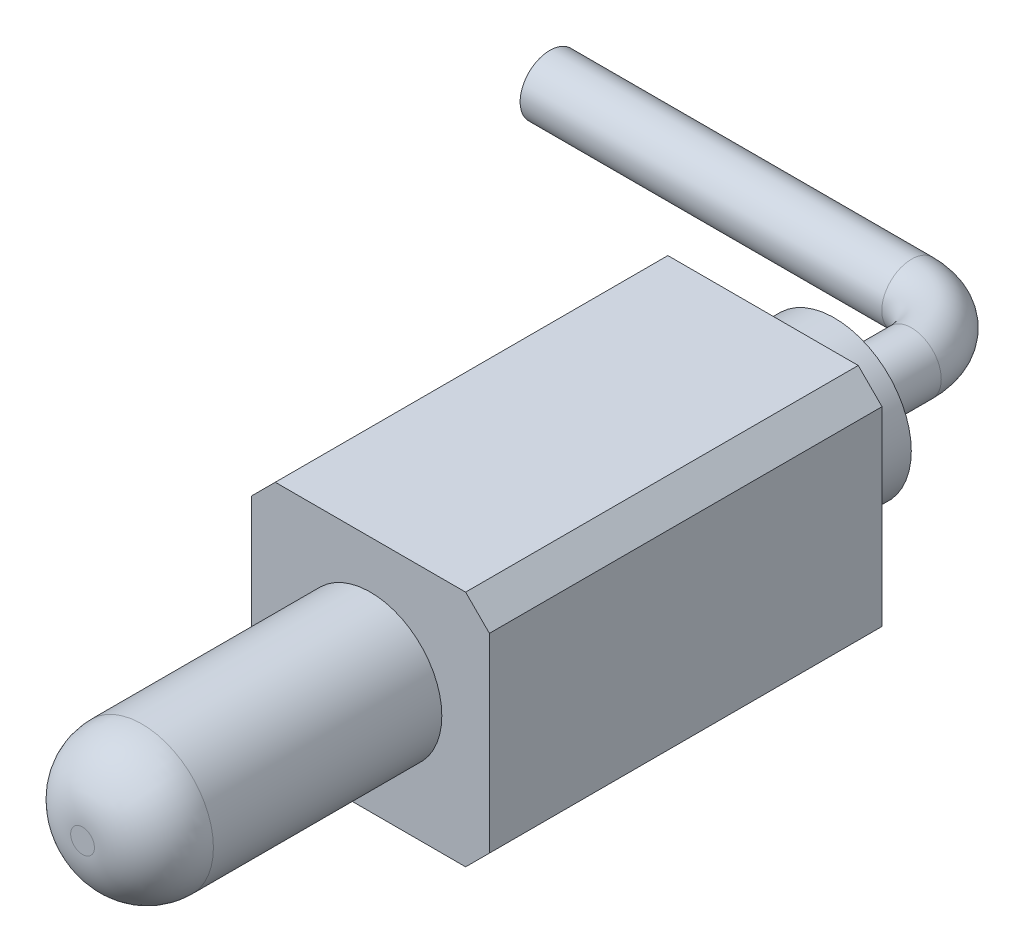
ISO-10303-21;
HEADER;
FILE_DESCRIPTION(('STEP AP214'),'2;1');
FILE_NAME('part.step','',(''),(''),'','','');
FILE_SCHEMA(('AUTOMOTIVE_DESIGN { 1 0 10303 214 1 1 1 1 }'));
ENDSEC;
DATA;
#1=APPLICATION_CONTEXT('core data for automotive mechanical design processes');
#2=APPLICATION_PROTOCOL_DEFINITION('international standard','automotive_design',2000,#1);
#3=PRODUCT_CONTEXT('',#1,'mechanical');
#4=PRODUCT('Part','Part','',(#3));
#5=PRODUCT_RELATED_PRODUCT_CATEGORY('part','',(#4));
#6=PRODUCT_DEFINITION_FORMATION('','',#4);
#7=PRODUCT_DEFINITION_CONTEXT('part definition',#1,'design');
#8=PRODUCT_DEFINITION('design','',#6,#7);
#9=PRODUCT_DEFINITION_SHAPE('','',#8);
#10=(LENGTH_UNIT() NAMED_UNIT(*) SI_UNIT(.MILLI.,.METRE.));
#11=(NAMED_UNIT(*) PLANE_ANGLE_UNIT() SI_UNIT($,.RADIAN.));
#12=(NAMED_UNIT(*) SI_UNIT($,.STERADIAN.) SOLID_ANGLE_UNIT());
#13=UNCERTAINTY_MEASURE_WITH_UNIT(LENGTH_MEASURE(1.E-05),#10,'distance_accuracy_value','');
#14=(GEOMETRIC_REPRESENTATION_CONTEXT(3) GLOBAL_UNCERTAINTY_ASSIGNED_CONTEXT((#13)) GLOBAL_UNIT_ASSIGNED_CONTEXT((#10,
#11,#12)) REPRESENTATION_CONTEXT('',''));
#15=CARTESIAN_POINT('',(0.,0.,0.));
#16=DIRECTION('',(0.,0.,1.));
#17=DIRECTION('',(1.,0.,0.));
#18=AXIS2_PLACEMENT_3D('',#15,#16,#17);
#19=CARTESIAN_POINT('',(-3.2258,1.27,-2.22006840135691));
#20=DIRECTION('',(1.,0.,0.));
#21=DIRECTION('',(0.,0.,-1.));
#22=AXIS2_PLACEMENT_3D('',#19,#20,#21);
#23=CYLINDRICAL_SURFACE('',#22,0.3175);
#24=CARTESIAN_POINT('',(-3.2258,1.27,-2.22006840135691));
#25=DIRECTION('',(-1.,0.,0.));
#26=DIRECTION('',(0.,0.,1.));
#27=AXIS2_PLACEMENT_3D('',#24,#25,#26);
#28=CIRCLE('',#27,0.3175);
#29=CARTESIAN_POINT('',(-3.2258,1.27,-1.90256840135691));
#30=VERTEX_POINT('',#29);
#31=EDGE_CURVE('E11',#30,#30,#28,.T.);
#32=ORIENTED_EDGE('',*,*,#31,.F.);
#33=EDGE_LOOP('',(#32));
#34=FACE_BOUND('',#33,.T.);
#35=CARTESIAN_POINT('',(0.635,1.27,-2.22006840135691));
#36=DIRECTION('',(1.,0.,0.));
#37=DIRECTION('',(0.,0.,-1.));
#38=AXIS2_PLACEMENT_3D('',#35,#36,#37);
#39=CIRCLE('',#38,0.3175);
#40=CARTESIAN_POINT('',(0.635,1.27,-2.53756840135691));
#41=VERTEX_POINT('',#40);
#42=EDGE_CURVE('E170',#41,#41,#39,.T.);
#43=ORIENTED_EDGE('',*,*,#42,.F.);
#44=EDGE_LOOP('',(#43));
#45=FACE_BOUND('',#44,.T.);
#46=ADVANCED_FACE('F33',(#34,#45),#23,.T.);
#47=CARTESIAN_POINT('',(-3.2258,1.27,-2.22006840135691));
#48=DIRECTION('',(-1.,0.,0.));
#49=DIRECTION('',(0.,0.,1.));
#50=AXIS2_PLACEMENT_3D('',#47,#48,#49);
#51=PLANE('',#50);
#52=ORIENTED_EDGE('',*,*,#31,.T.);
#53=EDGE_LOOP('',(#52));
#54=FACE_BOUND('',#53,.T.);
#55=ADVANCED_FACE('F184',(#54),#51,.T.);
#56=CARTESIAN_POINT('',(1.27,1.27,-1.58506840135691));
#57=DIRECTION('',(0.,0.,1.));
#58=DIRECTION('',(1.,0.,0.));
#59=AXIS2_PLACEMENT_3D('',#56,#57,#58);
#60=CYLINDRICAL_SURFACE('',#59,0.3175);
#61=CARTESIAN_POINT('',(1.27,1.27,-1.58506840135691));
#62=DIRECTION('',(0.,0.,1.));
#63=DIRECTION('',(1.,0.,0.));
#64=AXIS2_PLACEMENT_3D('',#61,#62,#63);
#65=CIRCLE('',#64,0.3175);
#66=CARTESIAN_POINT('',(1.5875,1.27,-1.58506840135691));
#67=VERTEX_POINT('',#66);
#68=EDGE_CURVE('E173',#67,#67,#65,.T.);
#69=ORIENTED_EDGE('',*,*,#68,.T.);
#70=EDGE_LOOP('',(#69));
#71=FACE_BOUND('',#70,.T.);
#72=CARTESIAN_POINT('',(1.27,1.27,-0.762));
#73=DIRECTION('',(0.,0.,1.));
#74=DIRECTION('',(1.,0.,0.));
#75=AXIS2_PLACEMENT_3D('',#72,#73,#74);
#76=CIRCLE('',#75,0.3175);
#77=CARTESIAN_POINT('',(1.5875,1.27,-0.762));
#78=VERTEX_POINT('',#77);
#79=EDGE_CURVE('E41',#78,#78,#76,.T.);
#80=ORIENTED_EDGE('',*,*,#79,.F.);
#81=EDGE_LOOP('',(#80));
#82=FACE_BOUND('',#81,.T.);
#83=ADVANCED_FACE('F181',(#71,#82),#60,.T.);
#84=CARTESIAN_POINT('',(0.635,1.27,-1.58506840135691));
#85=DIRECTION('',(0.,-1.,0.));
#86=DIRECTION('',(0.,0.,-1.));
#87=AXIS2_PLACEMENT_3D('',#84,#85,#86);
#88=TOROIDAL_SURFACE('',#87,0.635,0.3175);
#89=CARTESIAN_POINT('',(0.635,1.27,-1.58506840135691));
#90=DIRECTION('',(0.,-1.,0.));
#91=DIRECTION('',(0.,0.,-1.));
#92=AXIS2_PLACEMENT_3D('',#89,#90,#91);
#93=CIRCLE('',#92,0.9525);
#94=EDGE_CURVE('',#41,#67,#93,.T.);
#95=ORIENTED_EDGE('',*,*,#42,.T.);
#96=ORIENTED_EDGE('',*,*,#68,.F.);
#97=ORIENTED_EDGE('',*,*,#94,.T.);
#98=ORIENTED_EDGE('',*,*,#94,.F.);
#99=EDGE_LOOP('',(#95,#97,#96,#98));
#100=FACE_BOUND('',#99,.T.);
#101=ADVANCED_FACE('F183',(#100),#88,.T.);
#102=CARTESIAN_POINT('',(0.,0.,0.));
#103=DIRECTION('',(0.,0.,1.));
#104=DIRECTION('',(1.,0.,0.));
#105=AXIS2_PLACEMENT_3D('',#102,#103,#104);
#106=PLANE('',#105);
#107=DIRECTION('',(-1.,0.,0.));
#108=VECTOR('',#107,1.);
#109=CARTESIAN_POINT('',(0.254,2.54,0.));
#110=LINE('',#109,#108);
#111=CARTESIAN_POINT('',(2.286,2.54,0.));
#112=VERTEX_POINT('',#111);
#113=CARTESIAN_POINT('',(0.254,2.54,0.));
#114=VERTEX_POINT('',#113);
#115=EDGE_CURVE('E131',#112,#114,#110,.T.);
#116=ORIENTED_EDGE('',*,*,#115,.F.);
#117=DIRECTION('',(-0.707106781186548,0.707106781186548,0.));
#118=VECTOR('',#117,1.);
#119=CARTESIAN_POINT('',(2.286,2.54,0.));
#120=LINE('',#119,#118);
#121=CARTESIAN_POINT('',(2.54,2.286,0.));
#122=VERTEX_POINT('',#121);
#123=EDGE_CURVE('E84',#122,#112,#120,.T.);
#124=ORIENTED_EDGE('',*,*,#123,.F.);
#125=DIRECTION('',(0.,1.,0.));
#126=VECTOR('',#125,1.);
#127=CARTESIAN_POINT('',(2.54,0.254,0.));
#128=LINE('',#127,#126);
#129=CARTESIAN_POINT('',(2.54,0.254,0.));
#130=VERTEX_POINT('',#129);
#131=EDGE_CURVE('E78',#130,#122,#128,.T.);
#132=ORIENTED_EDGE('',*,*,#131,.F.);
#133=DIRECTION('',(0.707106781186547,0.707106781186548,0.));
#134=VECTOR('',#133,1.);
#135=CARTESIAN_POINT('',(2.286,0.,0.));
#136=LINE('',#135,#134);
#137=CARTESIAN_POINT('',(2.286,0.,0.));
#138=VERTEX_POINT('',#137);
#139=EDGE_CURVE('E121',#138,#130,#136,.T.);
#140=ORIENTED_EDGE('',*,*,#139,.F.);
#141=DIRECTION('',(1.,0.,0.));
#142=VECTOR('',#141,1.);
#143=CARTESIAN_POINT('',(0.254,0.,0.));
#144=LINE('',#143,#142);
#145=CARTESIAN_POINT('',(0.254,0.,0.));
#146=VERTEX_POINT('',#145);
#147=EDGE_CURVE('E141',#146,#138,#144,.T.);
#148=ORIENTED_EDGE('',*,*,#147,.F.);
#149=DIRECTION('',(0.707106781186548,-0.707106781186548,0.));
#150=VECTOR('',#149,1.);
#151=CARTESIAN_POINT('',(0.,0.254,0.));
#152=LINE('',#151,#150);
#153=CARTESIAN_POINT('',(0.,0.254,0.));
#154=VERTEX_POINT('',#153);
#155=EDGE_CURVE('E139',#154,#146,#152,.T.);
#156=ORIENTED_EDGE('',*,*,#155,.F.);
#157=DIRECTION('',(0.,-1.,0.));
#158=VECTOR('',#157,1.);
#159=CARTESIAN_POINT('',(0.,0.254,0.));
#160=LINE('',#159,#158);
#161=CARTESIAN_POINT('',(0.,2.286,0.));
#162=VERTEX_POINT('',#161);
#163=EDGE_CURVE('E137',#162,#154,#160,.T.);
#164=ORIENTED_EDGE('',*,*,#163,.F.);
#165=DIRECTION('',(-0.707106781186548,-0.707106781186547,0.));
#166=VECTOR('',#165,1.);
#167=CARTESIAN_POINT('',(0.,2.286,0.));
#168=LINE('',#167,#166);
#169=EDGE_CURVE('E134',#114,#162,#168,.T.);
#170=ORIENTED_EDGE('',*,*,#169,.F.);
#171=EDGE_LOOP('',(#116,#124,#132,#140,#148,#156,#164,#170));
#172=FACE_BOUND('',#171,.T.);
#173=CARTESIAN_POINT('',(1.27,1.27,0.));
#174=DIRECTION('',(0.,0.,1.));
#175=DIRECTION('',(1.,0.,0.));
#176=AXIS2_PLACEMENT_3D('',#173,#174,#175);
#177=CIRCLE('',#176,0.820584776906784);
#178=CARTESIAN_POINT('',(2.09058477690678,1.27,0.));
#179=VERTEX_POINT('',#178);
#180=EDGE_CURVE('E167',#179,#179,#177,.F.);
#181=ORIENTED_EDGE('',*,*,#180,.F.);
#182=EDGE_LOOP('',(#181));
#183=FACE_BOUND('',#182,.T.);
#184=ADVANCED_FACE('F191',(#172,#183),#106,.F.);
#185=CARTESIAN_POINT('',(0.,0.,4.191));
#186=DIRECTION('',(0.,0.,1.));
#187=DIRECTION('',(1.,0.,0.));
#188=AXIS2_PLACEMENT_3D('',#185,#186,#187);
#189=PLANE('',#188);
#190=DIRECTION('',(-1.,0.,0.));
#191=VECTOR('',#190,1.);
#192=CARTESIAN_POINT('',(0.254,2.54,4.191));
#193=LINE('',#192,#191);
#194=CARTESIAN_POINT('',(2.286,2.54,4.191));
#195=VERTEX_POINT('',#194);
#196=CARTESIAN_POINT('',(0.254,2.54,4.191));
#197=VERTEX_POINT('',#196);
#198=EDGE_CURVE('E146',#195,#197,#193,.T.);
#199=ORIENTED_EDGE('',*,*,#198,.T.);
#200=DIRECTION('',(-0.707106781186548,-0.707106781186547,0.));
#201=VECTOR('',#200,1.);
#202=CARTESIAN_POINT('',(0.,2.286,4.191));
#203=LINE('',#202,#201);
#204=CARTESIAN_POINT('',(0.,2.286,4.191));
#205=VERTEX_POINT('',#204);
#206=EDGE_CURVE('E93',#197,#205,#203,.T.);
#207=ORIENTED_EDGE('',*,*,#206,.T.);
#208=DIRECTION('',(0.,-1.,0.));
#209=VECTOR('',#208,1.);
#210=CARTESIAN_POINT('',(0.,0.254,4.191));
#211=LINE('',#210,#209);
#212=CARTESIAN_POINT('',(0.,0.254,4.191));
#213=VERTEX_POINT('',#212);
#214=EDGE_CURVE('E378',#205,#213,#211,.T.);
#215=ORIENTED_EDGE('',*,*,#214,.T.);
#216=DIRECTION('',(0.707106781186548,-0.707106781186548,0.));
#217=VECTOR('',#216,1.);
#218=CARTESIAN_POINT('',(0.,0.254,4.191));
#219=LINE('',#218,#217);
#220=CARTESIAN_POINT('',(0.254,0.,4.191));
#221=VERTEX_POINT('',#220);
#222=EDGE_CURVE('E380',#213,#221,#219,.T.);
#223=ORIENTED_EDGE('',*,*,#222,.T.);
#224=DIRECTION('',(1.,0.,0.));
#225=VECTOR('',#224,1.);
#226=CARTESIAN_POINT('',(0.254,0.,4.191));
#227=LINE('',#226,#225);
#228=CARTESIAN_POINT('',(2.286,0.,4.191));
#229=VERTEX_POINT('',#228);
#230=EDGE_CURVE('E113',#221,#229,#227,.T.);
#231=ORIENTED_EDGE('',*,*,#230,.T.);
#232=DIRECTION('',(0.707106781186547,0.707106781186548,0.));
#233=VECTOR('',#232,1.);
#234=CARTESIAN_POINT('',(2.286,0.,4.191));
#235=LINE('',#234,#233);
#236=CARTESIAN_POINT('',(2.54,0.254,4.191));
#237=VERTEX_POINT('',#236);
#238=EDGE_CURVE('E106',#229,#237,#235,.T.);
#239=ORIENTED_EDGE('',*,*,#238,.T.);
#240=DIRECTION('',(0.,1.,0.));
#241=VECTOR('',#240,1.);
#242=CARTESIAN_POINT('',(2.54,0.254,4.191));
#243=LINE('',#242,#241);
#244=CARTESIAN_POINT('',(2.54,2.286,4.191));
#245=VERTEX_POINT('',#244);
#246=EDGE_CURVE('E111',#237,#245,#243,.T.);
#247=ORIENTED_EDGE('',*,*,#246,.T.);
#248=DIRECTION('',(-0.707106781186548,0.707106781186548,0.));
#249=VECTOR('',#248,1.);
#250=CARTESIAN_POINT('',(2.286,2.54,4.191));
#251=LINE('',#250,#249);
#252=EDGE_CURVE('E49',#245,#195,#251,.T.);
#253=ORIENTED_EDGE('',*,*,#252,.T.);
#254=EDGE_LOOP('',(#199,#207,#215,#223,#231,#239,#247,#253));
#255=FACE_BOUND('',#254,.T.);
#256=CARTESIAN_POINT('',(1.27,1.27,4.191));
#257=DIRECTION('',(0.,0.,1.));
#258=DIRECTION('',(1.,0.,0.));
#259=AXIS2_PLACEMENT_3D('',#256,#257,#258);
#260=CIRCLE('',#259,0.762);
#261=CARTESIAN_POINT('',(2.032,1.27,4.191));
#262=VERTEX_POINT('',#261);
#263=EDGE_CURVE('E135',#262,#262,#260,.T.);
#264=ORIENTED_EDGE('',*,*,#263,.F.);
#265=EDGE_LOOP('',(#264));
#266=FACE_BOUND('',#265,.T.);
#267=ADVANCED_FACE('F108',(#255,#266),#189,.T.);
#268=CARTESIAN_POINT('',(0.254,2.54,4.191));
#269=DIRECTION('',(0.,-1.,0.));
#270=DIRECTION('',(0.,0.,-1.));
#271=AXIS2_PLACEMENT_3D('',#268,#269,#270);
#272=PLANE('',#271);
#273=ORIENTED_EDGE('',*,*,#115,.T.);
#274=DIRECTION('',(0.,0.,-1.));
#275=VECTOR('',#274,1.);
#276=CARTESIAN_POINT('',(0.254,2.54,4.191));
#277=LINE('',#276,#275);
#278=EDGE_CURVE('E159',#197,#114,#277,.T.);
#279=ORIENTED_EDGE('',*,*,#278,.F.);
#280=ORIENTED_EDGE('',*,*,#198,.F.);
#281=DIRECTION('',(0.,0.,-1.));
#282=VECTOR('',#281,1.);
#283=CARTESIAN_POINT('',(2.286,2.54,4.191));
#284=LINE('',#283,#282);
#285=EDGE_CURVE('E127',#195,#112,#284,.T.);
#286=ORIENTED_EDGE('',*,*,#285,.T.);
#287=EDGE_LOOP('',(#273,#279,#280,#286));
#288=FACE_BOUND('',#287,.T.);
#289=ADVANCED_FACE('F230',(#288),#272,.F.);
#290=CARTESIAN_POINT('',(0.,2.286,4.191));
#291=DIRECTION('',(0.707106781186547,-0.707106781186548,0.));
#292=DIRECTION('',(0.707106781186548,0.707106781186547,0.));
#293=AXIS2_PLACEMENT_3D('',#290,#291,#292);
#294=PLANE('',#293);
#295=ORIENTED_EDGE('',*,*,#169,.T.);
#296=DIRECTION('',(0.,0.,-1.));
#297=VECTOR('',#296,1.);
#298=CARTESIAN_POINT('',(0.,2.286,4.191));
#299=LINE('',#298,#297);
#300=EDGE_CURVE('E156',#205,#162,#299,.T.);
#301=ORIENTED_EDGE('',*,*,#300,.F.);
#302=ORIENTED_EDGE('',*,*,#206,.F.);
#303=ORIENTED_EDGE('',*,*,#278,.T.);
#304=EDGE_LOOP('',(#295,#301,#302,#303));
#305=FACE_BOUND('',#304,.T.);
#306=ADVANCED_FACE('F238',(#305),#294,.F.);
#307=CARTESIAN_POINT('',(0.,0.254,4.191));
#308=DIRECTION('',(1.,0.,0.));
#309=DIRECTION('',(0.,0.,-1.));
#310=AXIS2_PLACEMENT_3D('',#307,#308,#309);
#311=PLANE('',#310);
#312=ORIENTED_EDGE('',*,*,#163,.T.);
#313=DIRECTION('',(0.,0.,-1.));
#314=VECTOR('',#313,1.);
#315=CARTESIAN_POINT('',(0.,0.254,4.191));
#316=LINE('',#315,#314);
#317=EDGE_CURVE('E153',#213,#154,#316,.T.);
#318=ORIENTED_EDGE('',*,*,#317,.F.);
#319=ORIENTED_EDGE('',*,*,#214,.F.);
#320=ORIENTED_EDGE('',*,*,#300,.T.);
#321=EDGE_LOOP('',(#312,#318,#319,#320));
#322=FACE_BOUND('',#321,.T.);
#323=ADVANCED_FACE('F247',(#322),#311,.F.);
#324=CARTESIAN_POINT('',(0.,0.254,4.191));
#325=DIRECTION('',(0.707106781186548,0.707106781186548,0.));
#326=DIRECTION('',(-0.707106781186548,0.707106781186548,0.));
#327=AXIS2_PLACEMENT_3D('',#324,#325,#326);
#328=PLANE('',#327);
#329=ORIENTED_EDGE('',*,*,#155,.T.);
#330=DIRECTION('',(0.,0.,-1.));
#331=VECTOR('',#330,1.);
#332=CARTESIAN_POINT('',(0.254,0.,4.191));
#333=LINE('',#332,#331);
#334=EDGE_CURVE('E150',#221,#146,#333,.T.);
#335=ORIENTED_EDGE('',*,*,#334,.F.);
#336=ORIENTED_EDGE('',*,*,#222,.F.);
#337=ORIENTED_EDGE('',*,*,#317,.T.);
#338=EDGE_LOOP('',(#329,#335,#336,#337));
#339=FACE_BOUND('',#338,.T.);
#340=ADVANCED_FACE('F255',(#339),#328,.F.);
#341=CARTESIAN_POINT('',(0.254,0.,4.191));
#342=DIRECTION('',(0.,1.,0.));
#343=DIRECTION('',(0.,0.,1.));
#344=AXIS2_PLACEMENT_3D('',#341,#342,#343);
#345=PLANE('',#344);
#346=ORIENTED_EDGE('',*,*,#147,.T.);
#347=DIRECTION('',(0.,0.,-1.));
#348=VECTOR('',#347,1.);
#349=CARTESIAN_POINT('',(2.286,0.,4.191));
#350=LINE('',#349,#348);
#351=EDGE_CURVE('E122',#229,#138,#350,.T.);
#352=ORIENTED_EDGE('',*,*,#351,.F.);
#353=ORIENTED_EDGE('',*,*,#230,.F.);
#354=ORIENTED_EDGE('',*,*,#334,.T.);
#355=EDGE_LOOP('',(#346,#352,#353,#354));
#356=FACE_BOUND('',#355,.T.);
#357=ADVANCED_FACE('F264',(#356),#345,.F.);
#358=CARTESIAN_POINT('',(2.286,0.,4.191));
#359=DIRECTION('',(-0.707106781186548,0.707106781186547,0.));
#360=DIRECTION('',(-0.707106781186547,-0.707106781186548,0.));
#361=AXIS2_PLACEMENT_3D('',#358,#359,#360);
#362=PLANE('',#361);
#363=ORIENTED_EDGE('',*,*,#139,.T.);
#364=DIRECTION('',(0.,0.,-1.));
#365=VECTOR('',#364,1.);
#366=CARTESIAN_POINT('',(2.54,0.254,4.191));
#367=LINE('',#366,#365);
#368=EDGE_CURVE('E118',#237,#130,#367,.T.);
#369=ORIENTED_EDGE('',*,*,#368,.F.);
#370=ORIENTED_EDGE('',*,*,#238,.F.);
#371=ORIENTED_EDGE('',*,*,#351,.T.);
#372=EDGE_LOOP('',(#363,#369,#370,#371));
#373=FACE_BOUND('',#372,.T.);
#374=ADVANCED_FACE('F119',(#373),#362,.F.);
#375=CARTESIAN_POINT('',(2.54,0.254,4.191));
#376=DIRECTION('',(-1.,0.,0.));
#377=DIRECTION('',(0.,0.,1.));
#378=AXIS2_PLACEMENT_3D('',#375,#376,#377);
#379=PLANE('',#378);
#380=ORIENTED_EDGE('',*,*,#131,.T.);
#381=DIRECTION('',(0.,0.,-1.));
#382=VECTOR('',#381,1.);
#383=CARTESIAN_POINT('',(2.54,2.286,4.191));
#384=LINE('',#383,#382);
#385=EDGE_CURVE('E123',#245,#122,#384,.T.);
#386=ORIENTED_EDGE('',*,*,#385,.F.);
#387=ORIENTED_EDGE('',*,*,#246,.F.);
#388=ORIENTED_EDGE('',*,*,#368,.T.);
#389=EDGE_LOOP('',(#380,#386,#387,#388));
#390=FACE_BOUND('',#389,.T.);
#391=ADVANCED_FACE('F125',(#390),#379,.F.);
#392=CARTESIAN_POINT('',(2.286,2.54,4.191));
#393=DIRECTION('',(-0.707106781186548,-0.707106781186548,0.));
#394=DIRECTION('',(0.707106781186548,-0.707106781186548,0.));
#395=AXIS2_PLACEMENT_3D('',#392,#393,#394);
#396=PLANE('',#395);
#397=ORIENTED_EDGE('',*,*,#123,.T.);
#398=ORIENTED_EDGE('',*,*,#285,.F.);
#399=ORIENTED_EDGE('',*,*,#252,.F.);
#400=ORIENTED_EDGE('',*,*,#385,.T.);
#401=EDGE_LOOP('',(#397,#398,#399,#400));
#402=FACE_BOUND('',#401,.T.);
#403=ADVANCED_FACE('F288',(#402),#396,.F.);
#404=CARTESIAN_POINT('',(1.27,1.27,7.2644));
#405=DIRECTION('',(0.,0.,-1.));
#406=DIRECTION('',(-1.,0.,0.));
#407=AXIS2_PLACEMENT_3D('',#404,#405,#406);
#408=CYLINDRICAL_SURFACE('',#407,0.762);
#409=CARTESIAN_POINT('',(1.27,1.27,6.6294));
#410=DIRECTION('',(0.,0.,1.));
#411=DIRECTION('',(1.,0.,0.));
#412=AXIS2_PLACEMENT_3D('',#409,#410,#411);
#413=CIRCLE('',#412,0.762);
#414=CARTESIAN_POINT('',(2.032,1.27,6.6294));
#415=VERTEX_POINT('',#414);
#416=EDGE_CURVE('E164',#415,#415,#413,.F.);
#417=ORIENTED_EDGE('',*,*,#416,.T.);
#418=EDGE_LOOP('',(#417));
#419=FACE_BOUND('',#418,.T.);
#420=ORIENTED_EDGE('',*,*,#263,.T.);
#421=EDGE_LOOP('',(#420));
#422=FACE_BOUND('',#421,.T.);
#423=ADVANCED_FACE('F296',(#419,#422),#408,.T.);
#424=CARTESIAN_POINT('',(1.27,1.27,7.2644));
#425=DIRECTION('',(0.,0.,1.));
#426=DIRECTION('',(1.,0.,0.));
#427=AXIS2_PLACEMENT_3D('',#424,#425,#426);
#428=PLANE('',#427);
#429=CARTESIAN_POINT('',(1.27,1.27,7.2644));
#430=DIRECTION('',(0.,0.,1.));
#431=DIRECTION('',(1.,0.,0.));
#432=AXIS2_PLACEMENT_3D('',#429,#430,#431);
#433=CIRCLE('',#432,0.127);
#434=CARTESIAN_POINT('',(1.397,1.27,7.2644));
#435=VERTEX_POINT('',#434);
#436=EDGE_CURVE('E161',#435,#435,#433,.T.);
#437=ORIENTED_EDGE('',*,*,#436,.T.);
#438=EDGE_LOOP('',(#437));
#439=FACE_BOUND('',#438,.T.);
#440=ADVANCED_FACE('F304',(#439),#428,.T.);
#441=CARTESIAN_POINT('',(1.27,1.27,6.6294));
#442=DIRECTION('',(0.,0.,1.));
#443=DIRECTION('',(1.,0.,0.));
#444=AXIS2_PLACEMENT_3D('',#441,#442,#443);
#445=DEGENERATE_TOROIDAL_SURFACE('',#444,0.127,0.635,.T.);
#446=ORIENTED_EDGE('',*,*,#416,.F.);
#447=EDGE_LOOP('',(#446));
#448=FACE_BOUND('',#447,.T.);
#449=ORIENTED_EDGE('',*,*,#436,.F.);
#450=EDGE_LOOP('',(#449));
#451=FACE_BOUND('',#450,.T.);
#452=ADVANCED_FACE('F313',(#448,#451),#445,.T.);
#453=CARTESIAN_POINT('',(1.27,1.27,-0.762));
#454=DIRECTION('',(0.,0.,1.));
#455=DIRECTION('',(1.,0.,0.));
#456=AXIS2_PLACEMENT_3D('',#453,#454,#455);
#457=CYLINDRICAL_SURFACE('',#456,0.820584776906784);
#458=CARTESIAN_POINT('',(1.27,1.27,-0.762));
#459=DIRECTION('',(0.,0.,-1.));
#460=DIRECTION('',(-1.,0.,0.));
#461=AXIS2_PLACEMENT_3D('',#458,#459,#460);
#462=CIRCLE('',#461,0.820584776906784);
#463=CARTESIAN_POINT('',(2.09058477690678,1.27,-0.762));
#464=VERTEX_POINT('',#463);
#465=EDGE_CURVE('E369',#464,#464,#462,.T.);
#466=CARTESIAN_POINT('',(2.09058477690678,1.27,-0.762));
#467=CARTESIAN_POINT('',(2.09058477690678,1.27,-0.7540625));
#468=CARTESIAN_POINT('',(2.09058477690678,1.27,-0.746125));
#469=CARTESIAN_POINT('',(2.09058477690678,1.27,-0.73025));
#470=CARTESIAN_POINT('',(2.09058477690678,1.27,-0.7223125));
#471=CARTESIAN_POINT('',(2.09058477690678,1.27,-0.7064375));
#472=CARTESIAN_POINT('',(2.09058477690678,1.27,-0.6985));
#473=CARTESIAN_POINT('',(2.09058477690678,1.27,-0.682625));
#474=CARTESIAN_POINT('',(2.09058477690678,1.27,-0.6746875));
#475=CARTESIAN_POINT('',(2.09058477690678,1.27,-0.6588125));
#476=CARTESIAN_POINT('',(2.09058477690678,1.27,-0.650875));
#477=CARTESIAN_POINT('',(2.09058477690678,1.27,-0.635));
#478=CARTESIAN_POINT('',(2.09058477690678,1.27,-0.6270625));
#479=CARTESIAN_POINT('',(2.09058477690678,1.27,-0.6111875));
#480=CARTESIAN_POINT('',(2.09058477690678,1.27,-0.60325));
#481=CARTESIAN_POINT('',(2.09058477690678,1.27,-0.587375));
#482=CARTESIAN_POINT('',(2.09058477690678,1.27,-0.5794375));
#483=CARTESIAN_POINT('',(2.09058477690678,1.27,-0.5635625));
#484=CARTESIAN_POINT('',(2.09058477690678,1.27,-0.555625));
#485=CARTESIAN_POINT('',(2.09058477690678,1.27,-0.53975));
#486=CARTESIAN_POINT('',(2.09058477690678,1.27,-0.5318125));
#487=CARTESIAN_POINT('',(2.09058477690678,1.27,-0.5159375));
#488=CARTESIAN_POINT('',(2.09058477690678,1.27,-0.508));
#489=CARTESIAN_POINT('',(2.09058477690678,1.27,-0.492125));
#490=CARTESIAN_POINT('',(2.09058477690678,1.27,-0.4841875));
#491=CARTESIAN_POINT('',(2.09058477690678,1.27,-0.4683125));
#492=CARTESIAN_POINT('',(2.09058477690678,1.27,-0.460375));
#493=CARTESIAN_POINT('',(2.09058477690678,1.27,-0.4445));
#494=CARTESIAN_POINT('',(2.09058477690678,1.27,-0.4365625));
#495=CARTESIAN_POINT('',(2.09058477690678,1.27,-0.4206875));
#496=CARTESIAN_POINT('',(2.09058477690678,1.27,-0.41275));
#497=CARTESIAN_POINT('',(2.09058477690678,1.27,-0.396875));
#498=CARTESIAN_POINT('',(2.09058477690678,1.27,-0.3889375));
#499=CARTESIAN_POINT('',(2.09058477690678,1.27,-0.3730625));
#500=CARTESIAN_POINT('',(2.09058477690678,1.27,-0.365125));
#501=CARTESIAN_POINT('',(2.09058477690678,1.27,-0.34925));
#502=CARTESIAN_POINT('',(2.09058477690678,1.27,-0.3413125));
#503=CARTESIAN_POINT('',(2.09058477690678,1.27,-0.3254375));
#504=CARTESIAN_POINT('',(2.09058477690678,1.27,-0.3175));
#505=CARTESIAN_POINT('',(2.09058477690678,1.27,-0.301625));
#506=CARTESIAN_POINT('',(2.09058477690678,1.27,-0.2936875));
#507=CARTESIAN_POINT('',(2.09058477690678,1.27,-0.2778125));
#508=CARTESIAN_POINT('',(2.09058477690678,1.27,-0.269875));
#509=CARTESIAN_POINT('',(2.09058477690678,1.27,-0.254));
#510=CARTESIAN_POINT('',(2.09058477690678,1.27,-0.2460625));
#511=CARTESIAN_POINT('',(2.09058477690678,1.27,-0.2301875));
#512=CARTESIAN_POINT('',(2.09058477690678,1.27,-0.22225));
#513=CARTESIAN_POINT('',(2.09058477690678,1.27,-0.206375));
#514=CARTESIAN_POINT('',(2.09058477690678,1.27,-0.1984375));
#515=CARTESIAN_POINT('',(2.09058477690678,1.27,-0.1825625));
#516=CARTESIAN_POINT('',(2.09058477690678,1.27,-0.174625));
#517=CARTESIAN_POINT('',(2.09058477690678,1.27,-0.15875));
#518=CARTESIAN_POINT('',(2.09058477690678,1.27,-0.1508125));
#519=CARTESIAN_POINT('',(2.09058477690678,1.27,-0.1349375));
#520=CARTESIAN_POINT('',(2.09058477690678,1.27,-0.127));
#521=CARTESIAN_POINT('',(2.09058477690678,1.27,-0.111125));
#522=CARTESIAN_POINT('',(2.09058477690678,1.27,-0.1031875));
#523=CARTESIAN_POINT('',(2.09058477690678,1.27,-0.0873125));
#524=CARTESIAN_POINT('',(2.09058477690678,1.27,-0.079375));
#525=CARTESIAN_POINT('',(2.09058477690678,1.27,-0.0635));
#526=CARTESIAN_POINT('',(2.09058477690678,1.27,-0.0555625));
#527=CARTESIAN_POINT('',(2.09058477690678,1.27,-0.0396875));
#528=CARTESIAN_POINT('',(2.09058477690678,1.27,-0.03175));
#529=CARTESIAN_POINT('',(2.09058477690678,1.27,-0.015875));
#530=CARTESIAN_POINT('',(2.09058477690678,1.27,-0.00793749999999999));
#531=CARTESIAN_POINT('',(2.09058477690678,1.27,0.));
#532=B_SPLINE_CURVE_WITH_KNOTS('',3,(#466,#467,#468,#469,#470,#471,#472,#473,#474,#475,#476,
#477,#478,#479,#480,#481,#482,#483,#484,#485,#486,#487,#488,#489,#490,#491,#492,#493,#494,#495,
#496,#497,#498,#499,#500,#501,#502,#503,#504,#505,#506,#507,#508,#509,#510,#511,#512,#513,#514,
#515,#516,#517,#518,#519,#520,#521,#522,#523,#524,#525,#526,#527,#528,#529,#530,#531),
.UNSPECIFIED.,.F.,.F.,(4,2,2,2,2,2,2,2,2,2,2,2,2,2,2,2,2,2,2,2,2,2,2,2,2,2,2,2,2,2,2,2,4),(0.,
0.0238125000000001,0.047625,0.0714375,0.0952500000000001,0.1190625,0.142875,0.1666875,0.1905,
0.2143125,0.238125,0.2619375,0.28575,0.3095625,0.333375,0.3571875,0.381,0.4048125,0.428625,
0.4524375,0.47625,0.5000625,0.523875,0.5476875,0.5715,0.5953125,0.619125,0.6429375,0.66675,
0.6905625,0.714375,0.7381875,0.762),.UNSPECIFIED.);
#533=EDGE_CURVE('BSEAM322',#464,#179,#532,.T.);
#534=ORIENTED_EDGE('',*,*,#465,.F.);
#535=ORIENTED_EDGE('',*,*,#180,.T.);
#536=ORIENTED_EDGE('',*,*,#533,.T.);
#537=ORIENTED_EDGE('',*,*,#533,.F.);
#538=EDGE_LOOP('',(#534,#536,#535,#537));
#539=FACE_BOUND('',#538,.T.);
#540=ADVANCED_FACE('F322',(#539),#457,.T.);
#541=CARTESIAN_POINT('',(1.27,1.27,-0.762));
#542=DIRECTION('',(0.,0.,-1.));
#543=DIRECTION('',(-1.,0.,0.));
#544=AXIS2_PLACEMENT_3D('',#541,#542,#543);
#545=PLANE('',#544);
#546=ORIENTED_EDGE('',*,*,#79,.T.);
#547=EDGE_LOOP('',(#546));
#548=FACE_BOUND('',#547,.T.);
#549=ORIENTED_EDGE('',*,*,#465,.T.);
#550=EDGE_LOOP('',(#549));
#551=FACE_BOUND('',#550,.T.);
#552=ADVANCED_FACE('F178',(#548,#551),#545,.T.);
#553=CLOSED_SHELL('',(#46,#55,#83,#101,#184,#267,#289,#306,#323,#340,#357,#374,#391,#403,#423,
#440,#452,#540,#552));
#554=MANIFOLD_SOLID_BREP('B2',#553);
#555=ADVANCED_BREP_SHAPE_REPRESENTATION('',(#18,#554),#14);
#556=SHAPE_DEFINITION_REPRESENTATION(#9,#555);
ENDSEC;
END-ISO-10303-21;
